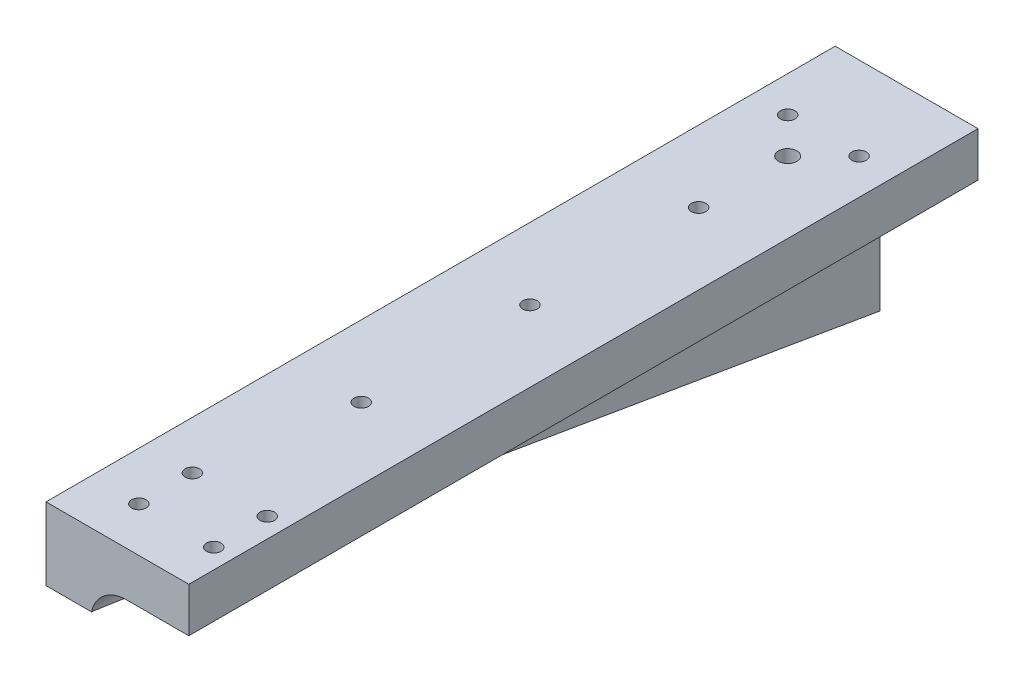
from build123d import *

# Parameters (mm, degrees)
SKETCH1_W                            = 25.4
SKETCH1_H                            = 7.9375
EXTRUDE1_DEPTH                       = 169.545
EXTRUDE2_DEPTH                       = 7.9375
FILLET1_R                            = 6.35
F_8_32_TAPPED_HOLE1_D                = 3.4544
F_8_32_TAPPED_HOLE1_DEPTH            = 10.70864
F_5_40_TAPPED_HOLE1_D                = 2.5781
F_5_40_TAPPED_HOLE1_DEPTH            = 10.795
F_5_40_TAPPED_HOLE1_TIP              = 0.774539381
F_5_40_TAPPED_HOLE2_D                = 2.5781
F_5_40_TAPPED_HOLE3_D                = 2.5781
F_3_16_0_187500_DIAMETER_HOLE1_D     = 4.7879
F_3_16_0_187500_DIAMETER_HOLE1_DEPTH = 6.35
F_3_16_0_187500_DIAMETER_HOLE1_TIP   = 1.438430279
F_5_40_TAPPED_HOLE4_D                = 2.5781
F_5_40_TAPPED_HOLE4_DEPTH            = 10.795
F_3_32_0_09375_DIAMETER_HOLE1_D      = 2.38125
F_3_32_0_09375_DIAMETER_HOLE1_DEPTH  = 3.81
F_5_CLEARANCE_HOLE1_D                = 3.2639
F_5_CLEARANCE_HOLE1_DEPTH            = 19.05
F_5_CLEARANCE_HOLE1_TIP              = 0.980574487
CUT_EXTRUDE5_REACH                   = 175.963
SKETCH26_W                           = 25.4
SKETCH26_H                           = 29.1625


with BuildPart() as part:
    # Sketch1 → Extrude1 (new body)
    with BuildSketch(Plane.XY):
        with Locations((0, -0.00635)):
            Rectangle(SKETCH1_W, SKETCH1_H)
    extrude(amount=EXTRUDE1_DEPTH)

    # Sketch3 → Extrude2 (add)
    with BuildSketch(Plane.ZY.offset(12.7)):
        Polygon((0, -3.9751), (0, -32.8676), (169.545, -3.9751), align=None)
    extrude(amount=-EXTRUDE2_DEPTH)

    # Fillet1
    fillet1_edges = [part.edges().sort_by_distance(p)[0] for p in [
        (-4.7625, -3.9751, 84.7725),
    ]]
    fillet(fillet1_edges, radius=FILLET1_R)

    # 8-32 Tapped Hole1
    with Locations(Plane(origin=(0, 0, 0), x_dir=(-1, 0, 0), z_dir=(0, 0, -1))):
        with Locations((8.7376, 0), (8.7376, -25.2476), (-8.7376, 0)):
            Hole(F_8_32_TAPPED_HOLE1_D / 2, depth=F_8_32_TAPPED_HOLE1_DEPTH)

    # 5-40 Tapped Hole1
    with Locations(Plane.ZY.offset(12.7)):
        with Locations((6.54558, -4.4958)):
            Hole(F_5_40_TAPPED_HOLE1_D / 2, depth=F_5_40_TAPPED_HOLE1_DEPTH)
            with Locations((0, 0, -(F_5_40_TAPPED_HOLE1_DEPTH + F_5_40_TAPPED_HOLE1_TIP / 2))):  # 118° drill point
                Cone(0, F_5_40_TAPPED_HOLE1_D / 2, F_5_40_TAPPED_HOLE1_TIP, mode=Mode.SUBTRACT)

    # 5-40 Tapped Hole2 (through all)
    with Locations(Plane(origin=(0, 3.9624, 0), x_dir=(-1, 0, 0), z_dir=(0, 1, 0))):
        with Locations((-9.2075, 132.445), (4.1275, 132.445), (4.1275, 122.92), (-9.2075, 122.92)):
            Hole(F_5_40_TAPPED_HOLE2_D / 2)

    # 5-40 Tapped Hole3 (through all)
    with Locations(Plane(origin=(0, 3.9624, 0), x_dir=(-1, 0, 0), z_dir=(0, 1, 0))):
        with Locations((0, 36.997248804), (0, 66.997248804), (0, 96.997248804)):
            Hole(F_5_40_TAPPED_HOLE3_D / 2)

    # 3_16 _0.187500_ Diameter Hole1
    with Locations(Plane(origin=(0, 0, 0), x_dir=(-1, 0, 0), z_dir=(0, 0, -1))):
        with Locations((8.7376, -12.6238), (0, 0)):
            Hole(F_3_16_0_187500_DIAMETER_HOLE1_D / 2, depth=F_3_16_0_187500_DIAMETER_HOLE1_DEPTH)
            with Locations((0, 0, -(F_3_16_0_187500_DIAMETER_HOLE1_DEPTH + F_3_16_0_187500_DIAMETER_HOLE1_TIP / 2))):  # 118° drill point
                Cone(0, F_3_16_0_187500_DIAMETER_HOLE1_D / 2, F_3_16_0_187500_DIAMETER_HOLE1_TIP, mode=Mode.SUBTRACT)

    # 5-40 Tapped Hole4
    with Locations(Plane(origin=(0, 3.9624, 0), x_dir=(-1, 0, 0), z_dir=(0, 1, 0))):
        with Locations((6.35, 14.8082), (-6.35, 14.8082)):
            Hole(F_5_40_TAPPED_HOLE4_D / 2, depth=F_5_40_TAPPED_HOLE4_DEPTH)

    # 3_32 _0.09375_ Diameter Hole1
    with Locations(Plane.ZY.offset(12.7)):
        with Locations((6.54558, -16.4338)):
            Hole(F_3_32_0_09375_DIAMETER_HOLE1_D / 2, depth=F_3_32_0_09375_DIAMETER_HOLE1_DEPTH)

    # 5 Clearance Hole1
    with Locations(Plane(origin=(0, 3.9624, 0), x_dir=(1, 0, 0), z_dir=(0, 1, 0))):
        with Locations((0, -21.1582)):
            Hole(F_5_CLEARANCE_HOLE1_D / 2, depth=F_5_CLEARANCE_HOLE1_DEPTH)
            with Locations((0, 0, -(F_5_CLEARANCE_HOLE1_DEPTH + F_5_CLEARANCE_HOLE1_TIP / 2))):  # 118° drill point
                Cone(0, F_5_CLEARANCE_HOLE1_D / 2, F_5_CLEARANCE_HOLE1_TIP, mode=Mode.SUBTRACT)

    # Sketch26 → Cut-Extrude5 (cut, up to next)
    with BuildSketch(Plane(origin=(0, 3.9624, 0), x_dir=(1, 0, 0), z_dir=(0, 1, 0)), mode=Mode.PRIVATE) as cut_extrude5_sk1:
        with Locations((0, -154.96375)):
            Rectangle(SKETCH26_W, SKETCH26_H)
    cut_extrude5_tool1 = extrude(cut_extrude5_sk1.sketch, amount=-CUT_EXTRUDE5_REACH, mode=Mode.PRIVATE) & part.part
    add(cut_extrude5_tool1.solids().sort_by_distance((0, 3.9624, 154.96375))[0], mode=Mode.SUBTRACT)


solid = part.part
